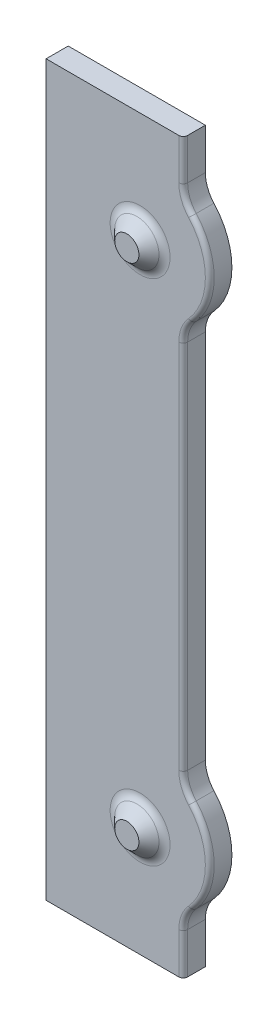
from build123d import *

# Parameters (mm, degrees)
BOSS_EXTRUDE1_DEPTH  = 2.54
FILLET1_R            = 3.81
FILLET2_R            = 0.508
FILLET3_R            = 1.27
FILLET3_OF_MIRROR1_R = 1.27


with BuildPart() as part:
    # Sketch1 → Boss-Extrude1 (new body)
    with BuildSketch(Plane.XY):
        with BuildLine():
            Line((-10.795, 41.843612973), (4.953, 41.843612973))
            Line((4.953, 41.843612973), (4.953, 35.493612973))
            ThreePointArc((4.953, 35.493612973), (8.001, 29.21), (4.953, 22.926387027))
            Line((4.953, 22.926387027), (4.953, -22.926387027))
            ThreePointArc((4.953, -22.926387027), (8.001, -29.21), (4.953, -35.493612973))
            Line((4.953, -35.493612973), (4.953, -41.843612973))
            Line((4.953, -41.843612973), (-10.795, -41.843612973))
            Line((-10.795, -41.843612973), (-10.795, 41.843612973))
        make_face()
    extrude(amount=BOSS_EXTRUDE1_DEPTH)

    # Fillet1
    fillet1_edges = [part.edges().sort_by_distance(p)[0] for p in [
        (4.953, 35.493612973, 1.27),
        (4.953, 22.926387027, 1.27),
        (4.953, -22.926387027, 1.27),
        (4.953, -35.493612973, 1.27),
    ]]
    fillet(fillet1_edges, radius=FILLET1_R)

    # Fillet2
    fillet2_edges = [part.edges().sort_by_distance(p)[0] for p in [
        (4.953, -39.486274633, 2.54),
        (4.953, 39.486274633, 2.54),
        (8.001, 29.21, 2.54),
        (4.953, 0, 2.54),
        (8.001, -29.21, 2.54),
        (5.207292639, 35.760343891, 2.54),
        (5.207292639, 22.659656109, 2.54),
        (5.207292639, -22.659656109, 2.54),
        (5.207292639, -35.760343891, 2.54),
    ]]
    fillet(fillet2_edges, radius=FILLET2_R)

    # Sketch2 → Revolve1 (revolve)
    with BuildSketch(Plane(origin=(0.715600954, 29.21, 2.376375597), x_dir=(-1, 0, 0), z_dir=(0, 1, 0)), mode=Mode.PRIVATE) as revolve1_sk:
        Polygon((0.715600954, 0.163624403), (0.715600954, 1.687624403), (-0.673461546, 1.687624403), (-2.197461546, 0.163624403), align=None)
    revolve1 = revolve(revolve1_sk.sketch.rotate(Axis((0, 29.21, 4.064), (0, 0, 1)), 180), axis=Axis((0, 29.21, 4.064), (0, 0, 1)))

    # Fillet3
    fillet3_edges = [part.edges().sort_by_distance(p)[0] for p in [
        (2.9130625, 29.21, 2.54),
    ]]
    fillet(fillet3_edges, radius=FILLET3_R)

    # Mirror1: Revolve1 across plane
    add(revolve1.mirror(Plane.ZX))

    # Fillet3 of Mirror1
    fillet3_of_mirror1_edges = [part.edges().sort_by_distance(p)[0] for p in [
        (2.9130625, -29.21, 2.54),
    ]]
    fillet(fillet3_of_mirror1_edges, radius=FILLET3_OF_MIRROR1_R)


solid = part.part
